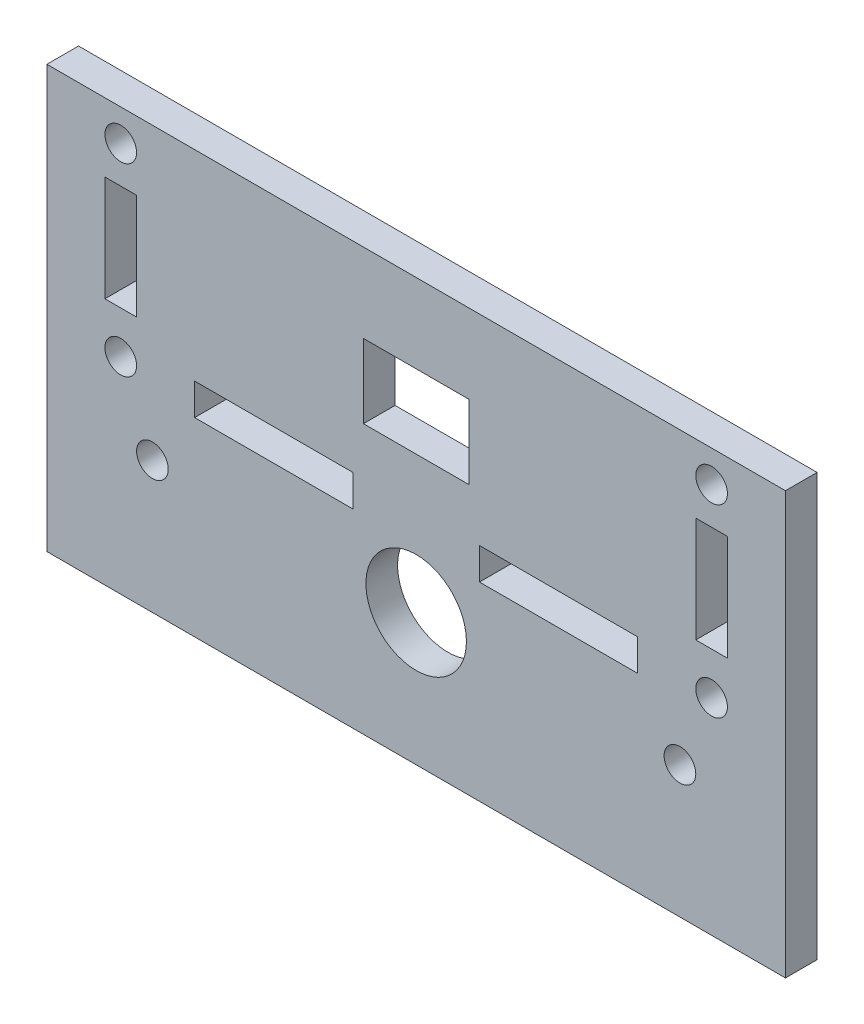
ISO-10303-21;
HEADER;
FILE_DESCRIPTION(('STEP AP214'),'2;1');
FILE_NAME('part.step','',(''),(''),'','','');
FILE_SCHEMA(('AUTOMOTIVE_DESIGN { 1 0 10303 214 1 1 1 1 }'));
ENDSEC;
DATA;
#1=APPLICATION_CONTEXT('core data for automotive mechanical design processes');
#2=APPLICATION_PROTOCOL_DEFINITION('international standard','automotive_design',2000,#1);
#3=PRODUCT_CONTEXT('',#1,'mechanical');
#4=PRODUCT('Part','Part','',(#3));
#5=PRODUCT_RELATED_PRODUCT_CATEGORY('part','',(#4));
#6=PRODUCT_DEFINITION_FORMATION('','',#4);
#7=PRODUCT_DEFINITION_CONTEXT('part definition',#1,'design');
#8=PRODUCT_DEFINITION('design','',#6,#7);
#9=PRODUCT_DEFINITION_SHAPE('','',#8);
#10=(LENGTH_UNIT() NAMED_UNIT(*) SI_UNIT(.MILLI.,.METRE.));
#11=(NAMED_UNIT(*) PLANE_ANGLE_UNIT() SI_UNIT($,.RADIAN.));
#12=(NAMED_UNIT(*) SI_UNIT($,.STERADIAN.) SOLID_ANGLE_UNIT());
#13=UNCERTAINTY_MEASURE_WITH_UNIT(LENGTH_MEASURE(1.E-05),#10,'distance_accuracy_value','');
#14=(GEOMETRIC_REPRESENTATION_CONTEXT(3) GLOBAL_UNCERTAINTY_ASSIGNED_CONTEXT((#13)) GLOBAL_UNIT_ASSIGNED_CONTEXT((#10,
#11,#12)) REPRESENTATION_CONTEXT('',''));
#15=CARTESIAN_POINT('',(0.,0.,0.));
#16=DIRECTION('',(0.,0.,1.));
#17=DIRECTION('',(1.,0.,0.));
#18=AXIS2_PLACEMENT_3D('',#15,#16,#17);
#19=CARTESIAN_POINT('',(0.,0.,3.));
#20=DIRECTION('',(0.,0.,1.));
#21=DIRECTION('',(1.,0.,0.));
#22=AXIS2_PLACEMENT_3D('',#19,#20,#21);
#23=PLANE('',#22);
#24=CARTESIAN_POINT('',(28.,24.5000000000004,3.));
#25=DIRECTION('',(0.,0.,1.));
#26=DIRECTION('',(1.,0.,0.));
#27=AXIS2_PLACEMENT_3D('',#24,#25,#26);
#28=CIRCLE('',#27,1.5);
#29=CARTESIAN_POINT('',(29.5,24.5000000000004,3.));
#30=VERTEX_POINT('',#29);
#31=EDGE_CURVE('E244',#30,#30,#28,.T.);
#32=ORIENTED_EDGE('',*,*,#31,.F.);
#33=EDGE_LOOP('',(#32));
#34=FACE_BOUND('',#33,.T.);
#35=DIRECTION('',(1.,0.,0.));
#36=VECTOR('',#35,1.);
#37=CARTESIAN_POINT('',(0.,11.0000000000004,3.));
#38=LINE('',#37,#36);
#39=CARTESIAN_POINT('',(26.5,11.0000000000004,3.));
#40=VERTEX_POINT('',#39);
#41=CARTESIAN_POINT('',(29.5,11.0000000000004,3.));
#42=VERTEX_POINT('',#41);
#43=EDGE_CURVE('E56',#40,#42,#38,.T.);
#44=ORIENTED_EDGE('',*,*,#43,.F.);
#45=DIRECTION('',(0.,1.,0.));
#46=VECTOR('',#45,1.);
#47=CARTESIAN_POINT('',(26.5,0.,3.));
#48=LINE('',#47,#46);
#49=CARTESIAN_POINT('',(26.5,21.0000000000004,3.));
#50=VERTEX_POINT('',#49);
#51=EDGE_CURVE('E237',#40,#50,#48,.T.);
#52=ORIENTED_EDGE('',*,*,#51,.T.);
#53=DIRECTION('',(1.,0.,0.));
#54=VECTOR('',#53,1.);
#55=CARTESIAN_POINT('',(0.,21.0000000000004,3.));
#56=LINE('',#55,#54);
#57=CARTESIAN_POINT('',(29.5,21.0000000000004,3.));
#58=VERTEX_POINT('',#57);
#59=EDGE_CURVE('E247',#50,#58,#56,.T.);
#60=ORIENTED_EDGE('',*,*,#59,.T.);
#61=DIRECTION('',(0.,1.,0.));
#62=VECTOR('',#61,1.);
#63=CARTESIAN_POINT('',(29.5,0.,3.));
#64=LINE('',#63,#62);
#65=EDGE_CURVE('E250',#42,#58,#64,.T.);
#66=ORIENTED_EDGE('',*,*,#65,.F.);
#67=EDGE_LOOP('',(#44,#52,#60,#66));
#68=FACE_BOUND('',#67,.T.);
#69=CARTESIAN_POINT('',(28.,7.00000000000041,3.));
#70=DIRECTION('',(0.,0.,1.));
#71=DIRECTION('',(1.,0.,0.));
#72=AXIS2_PLACEMENT_3D('',#69,#70,#71);
#73=CIRCLE('',#72,1.5);
#74=CARTESIAN_POINT('',(29.5,7.00000000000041,3.));
#75=VERTEX_POINT('',#74);
#76=EDGE_CURVE('E210',#75,#75,#73,.T.);
#77=ORIENTED_EDGE('',*,*,#76,.F.);
#78=EDGE_LOOP('',(#77));
#79=FACE_BOUND('',#78,.T.);
#80=DIRECTION('',(1.,0.,0.));
#81=VECTOR('',#80,1.);
#82=CARTESIAN_POINT('',(0.,5.50000000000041,3.));
#83=LINE('',#82,#81);
#84=CARTESIAN_POINT('',(-21.,5.50000000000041,3.));
#85=VERTEX_POINT('',#84);
#86=CARTESIAN_POINT('',(-6.,5.50000000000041,3.));
#87=VERTEX_POINT('',#86);
#88=EDGE_CURVE('E64',#85,#87,#83,.T.);
#89=ORIENTED_EDGE('',*,*,#88,.F.);
#90=DIRECTION('',(0.,1.,0.));
#91=VECTOR('',#90,1.);
#92=CARTESIAN_POINT('',(-21.,0.,3.));
#93=LINE('',#92,#91);
#94=CARTESIAN_POINT('',(-21.,8.50000000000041,3.));
#95=VERTEX_POINT('',#94);
#96=EDGE_CURVE('E213',#85,#95,#93,.T.);
#97=ORIENTED_EDGE('',*,*,#96,.T.);
#98=DIRECTION('',(1.,0.,0.));
#99=VECTOR('',#98,1.);
#100=CARTESIAN_POINT('',(0.,8.50000000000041,3.));
#101=LINE('',#100,#99);
#102=CARTESIAN_POINT('',(-6.,8.50000000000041,3.));
#103=VERTEX_POINT('',#102);
#104=EDGE_CURVE('E219',#95,#103,#101,.T.);
#105=ORIENTED_EDGE('',*,*,#104,.T.);
#106=DIRECTION('',(0.,1.,0.));
#107=VECTOR('',#106,1.);
#108=CARTESIAN_POINT('',(-6.,0.,3.));
#109=LINE('',#108,#107);
#110=EDGE_CURVE('E225',#87,#103,#109,.T.);
#111=ORIENTED_EDGE('',*,*,#110,.F.);
#112=EDGE_LOOP('',(#89,#97,#105,#111));
#113=FACE_BOUND('',#112,.T.);
#114=CARTESIAN_POINT('',(-28.,7.00000000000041,3.));
#115=DIRECTION('',(0.,0.,1.));
#116=DIRECTION('',(1.,0.,0.));
#117=AXIS2_PLACEMENT_3D('',#114,#115,#116);
#118=CIRCLE('',#117,1.5);
#119=CARTESIAN_POINT('',(-26.5,7.00000000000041,3.));
#120=VERTEX_POINT('',#119);
#121=EDGE_CURVE('E259',#120,#120,#118,.T.);
#122=ORIENTED_EDGE('',*,*,#121,.F.);
#123=EDGE_LOOP('',(#122));
#124=FACE_BOUND('',#123,.T.);
#125=DIRECTION('',(0.,1.,0.));
#126=VECTOR('',#125,1.);
#127=CARTESIAN_POINT('',(-26.5,-1.83880688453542E-13,3.));
#128=LINE('',#127,#126);
#129=CARTESIAN_POINT('',(-26.5000000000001,11.0000000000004,3.));
#130=VERTEX_POINT('',#129);
#131=CARTESIAN_POINT('',(-26.5000000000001,21.0000000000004,3.));
#132=VERTEX_POINT('',#131);
#133=EDGE_CURVE('E283',#130,#132,#128,.T.);
#134=ORIENTED_EDGE('',*,*,#133,.F.);
#135=DIRECTION('',(-1.,0.,0.));
#136=VECTOR('',#135,1.);
#137=CARTESIAN_POINT('',(0.,11.0000000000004,3.));
#138=LINE('',#137,#136);
#139=CARTESIAN_POINT('',(-29.5000000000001,11.0000000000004,3.));
#140=VERTEX_POINT('',#139);
#141=EDGE_CURVE('E280',#130,#140,#138,.T.);
#142=ORIENTED_EDGE('',*,*,#141,.T.);
#143=DIRECTION('',(0.,1.,0.));
#144=VECTOR('',#143,1.);
#145=CARTESIAN_POINT('',(-29.5,-2.04697370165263E-13,3.));
#146=LINE('',#145,#144);
#147=CARTESIAN_POINT('',(-29.5000000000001,21.0000000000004,3.));
#148=VERTEX_POINT('',#147);
#149=EDGE_CURVE('E289',#140,#148,#146,.T.);
#150=ORIENTED_EDGE('',*,*,#149,.T.);
#151=DIRECTION('',(-1.,0.,0.));
#152=VECTOR('',#151,1.);
#153=CARTESIAN_POINT('',(0.,21.0000000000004,3.));
#154=LINE('',#153,#152);
#155=EDGE_CURVE('E286',#132,#148,#154,.T.);
#156=ORIENTED_EDGE('',*,*,#155,.F.);
#157=EDGE_LOOP('',(#134,#142,#150,#156));
#158=FACE_BOUND('',#157,.T.);
#159=DIRECTION('',(1.,0.,0.));
#160=VECTOR('',#159,1.);
#161=CARTESIAN_POINT('',(0.,20.,3.));
#162=LINE('',#161,#160);
#163=CARTESIAN_POINT('',(-5.00000000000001,20.,3.));
#164=VERTEX_POINT('',#163);
#165=CARTESIAN_POINT('',(4.99999999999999,20.,3.));
#166=VERTEX_POINT('',#165);
#167=EDGE_CURVE('E323',#164,#166,#162,.T.);
#168=ORIENTED_EDGE('',*,*,#167,.T.);
#169=DIRECTION('',(0.,-1.,0.));
#170=VECTOR('',#169,1.);
#171=CARTESIAN_POINT('',(4.99999999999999,0.,3.));
#172=LINE('',#171,#170);
#173=CARTESIAN_POINT('',(4.99999999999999,13.,3.));
#174=VERTEX_POINT('',#173);
#175=EDGE_CURVE('E326',#166,#174,#172,.T.);
#176=ORIENTED_EDGE('',*,*,#175,.T.);
#177=DIRECTION('',(1.,0.,0.));
#178=VECTOR('',#177,1.);
#179=CARTESIAN_POINT('',(0.,13.,3.));
#180=LINE('',#179,#178);
#181=CARTESIAN_POINT('',(-5.00000000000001,13.,3.));
#182=VERTEX_POINT('',#181);
#183=EDGE_CURVE('E328',#182,#174,#180,.T.);
#184=ORIENTED_EDGE('',*,*,#183,.F.);
#185=DIRECTION('',(0.,-1.,0.));
#186=VECTOR('',#185,1.);
#187=CARTESIAN_POINT('',(-5.,0.,3.));
#188=LINE('',#187,#186);
#189=EDGE_CURVE('E331',#164,#182,#188,.T.);
#190=ORIENTED_EDGE('',*,*,#189,.F.);
#191=EDGE_LOOP('',(#168,#176,#184,#190));
#192=FACE_BOUND('',#191,.T.);
#193=DIRECTION('',(1.,0.,0.));
#194=VECTOR('',#193,1.);
#195=CARTESIAN_POINT('',(0.,-12.5,3.));
#196=LINE('',#195,#194);
#197=CARTESIAN_POINT('',(-35.,-12.5,3.));
#198=VERTEX_POINT('',#197);
#199=CARTESIAN_POINT('',(35.,-12.5,3.));
#200=VERTEX_POINT('',#199);
#201=EDGE_CURVE('E312',#198,#200,#196,.T.);
#202=ORIENTED_EDGE('',*,*,#201,.T.);
#203=DIRECTION('',(0.,1.,0.));
#204=VECTOR('',#203,1.);
#205=CARTESIAN_POINT('',(35.,0.,3.));
#206=LINE('',#205,#204);
#207=CARTESIAN_POINT('',(35.,27.5,3.));
#208=VERTEX_POINT('',#207);
#209=EDGE_CURVE('E315',#200,#208,#206,.T.);
#210=ORIENTED_EDGE('',*,*,#209,.T.);
#211=DIRECTION('',(1.,0.,0.));
#212=VECTOR('',#211,1.);
#213=CARTESIAN_POINT('',(0.,27.5,3.));
#214=LINE('',#213,#212);
#215=CARTESIAN_POINT('',(-35.,27.5,3.));
#216=VERTEX_POINT('',#215);
#217=EDGE_CURVE('E317',#216,#208,#214,.T.);
#218=ORIENTED_EDGE('',*,*,#217,.F.);
#219=DIRECTION('',(0.,1.,0.));
#220=VECTOR('',#219,1.);
#221=CARTESIAN_POINT('',(-35.,0.,3.));
#222=LINE('',#221,#220);
#223=EDGE_CURVE('E320',#198,#216,#222,.T.);
#224=ORIENTED_EDGE('',*,*,#223,.F.);
#225=EDGE_LOOP('',(#202,#210,#218,#224));
#226=FACE_BOUND('',#225,.T.);
#227=CARTESIAN_POINT('',(0.,0.,3.));
#228=DIRECTION('',(0.,0.,1.));
#229=DIRECTION('',(1.,0.,0.));
#230=AXIS2_PLACEMENT_3D('',#227,#228,#229);
#231=CIRCLE('',#230,4.7625);
#232=CARTESIAN_POINT('',(4.7625,0.,3.));
#233=VERTEX_POINT('',#232);
#234=EDGE_CURVE('E309',#233,#233,#231,.T.);
#235=ORIENTED_EDGE('',*,*,#234,.F.);
#236=EDGE_LOOP('',(#235));
#237=FACE_BOUND('',#236,.T.);
#238=CARTESIAN_POINT('',(-25.,0.,3.));
#239=DIRECTION('',(0.,0.,1.));
#240=DIRECTION('',(1.,0.,0.));
#241=AXIS2_PLACEMENT_3D('',#238,#239,#240);
#242=CIRCLE('',#241,1.5);
#243=CARTESIAN_POINT('',(-23.5,0.,3.));
#244=VERTEX_POINT('',#243);
#245=EDGE_CURVE('E305',#244,#244,#242,.T.);
#246=ORIENTED_EDGE('',*,*,#245,.F.);
#247=EDGE_LOOP('',(#246));
#248=FACE_BOUND('',#247,.T.);
#249=CARTESIAN_POINT('',(25.,0.,3.));
#250=DIRECTION('',(0.,0.,1.));
#251=DIRECTION('',(1.,0.,0.));
#252=AXIS2_PLACEMENT_3D('',#249,#250,#251);
#253=CIRCLE('',#252,1.5);
#254=CARTESIAN_POINT('',(26.5,0.,3.));
#255=VERTEX_POINT('',#254);
#256=EDGE_CURVE('E302',#255,#255,#253,.T.);
#257=ORIENTED_EDGE('',*,*,#256,.F.);
#258=EDGE_LOOP('',(#257));
#259=FACE_BOUND('',#258,.T.);
#260=DIRECTION('',(1.,0.,0.));
#261=VECTOR('',#260,1.);
#262=CARTESIAN_POINT('',(0.,5.50000000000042,3.));
#263=LINE('',#262,#261);
#264=CARTESIAN_POINT('',(6.,5.50000000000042,3.));
#265=VERTEX_POINT('',#264);
#266=CARTESIAN_POINT('',(21.,5.50000000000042,3.));
#267=VERTEX_POINT('',#266);
#268=EDGE_CURVE('E260',#265,#267,#263,.T.);
#269=ORIENTED_EDGE('',*,*,#268,.F.);
#270=DIRECTION('',(0.,1.,0.));
#271=VECTOR('',#270,1.);
#272=CARTESIAN_POINT('',(6.,0.,3.));
#273=LINE('',#272,#271);
#274=CARTESIAN_POINT('',(6.,8.50000000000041,3.));
#275=VERTEX_POINT('',#274);
#276=EDGE_CURVE('E264',#265,#275,#273,.T.);
#277=ORIENTED_EDGE('',*,*,#276,.T.);
#278=DIRECTION('',(1.,0.,0.));
#279=VECTOR('',#278,1.);
#280=CARTESIAN_POINT('',(0.,8.50000000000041,3.));
#281=LINE('',#280,#279);
#282=CARTESIAN_POINT('',(21.,8.50000000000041,3.));
#283=VERTEX_POINT('',#282);
#284=EDGE_CURVE('E270',#275,#283,#281,.T.);
#285=ORIENTED_EDGE('',*,*,#284,.T.);
#286=DIRECTION('',(0.,1.,0.));
#287=VECTOR('',#286,1.);
#288=CARTESIAN_POINT('',(21.,0.,3.));
#289=LINE('',#288,#287);
#290=EDGE_CURVE('E273',#267,#283,#289,.T.);
#291=ORIENTED_EDGE('',*,*,#290,.F.);
#292=EDGE_LOOP('',(#269,#277,#285,#291));
#293=FACE_BOUND('',#292,.T.);
#294=CARTESIAN_POINT('',(-28.0000000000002,24.5000000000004,3.));
#295=DIRECTION('',(0.,0.,1.));
#296=DIRECTION('',(1.,0.,0.));
#297=AXIS2_PLACEMENT_3D('',#294,#295,#296);
#298=CIRCLE('',#297,1.5);
#299=CARTESIAN_POINT('',(-26.5000000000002,24.5000000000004,3.));
#300=VERTEX_POINT('',#299);
#301=EDGE_CURVE('E256',#300,#300,#298,.F.);
#302=ORIENTED_EDGE('',*,*,#301,.T.);
#303=EDGE_LOOP('',(#302));
#304=FACE_BOUND('',#303,.T.);
#305=ADVANCED_FACE('F40',(#34,#68,#79,#113,#124,#158,#192,#226,#237,#248,#259,#293,#304),#23,.T.);
#306=CARTESIAN_POINT('',(0.,0.,0.));
#307=DIRECTION('',(0.,0.,1.));
#308=DIRECTION('',(1.,0.,0.));
#309=AXIS2_PLACEMENT_3D('',#306,#307,#308);
#310=PLANE('',#309);
#311=CARTESIAN_POINT('',(28.,24.5000000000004,0.));
#312=DIRECTION('',(0.,0.,1.));
#313=DIRECTION('',(1.,0.,0.));
#314=AXIS2_PLACEMENT_3D('',#311,#312,#313);
#315=CIRCLE('',#314,1.5);
#316=CARTESIAN_POINT('',(29.5,24.5000000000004,0.));
#317=VERTEX_POINT('',#316);
#318=EDGE_CURVE('E44',#317,#317,#315,.T.);
#319=ORIENTED_EDGE('',*,*,#318,.T.);
#320=EDGE_LOOP('',(#319));
#321=FACE_BOUND('',#320,.T.);
#322=DIRECTION('',(0.,1.,0.));
#323=VECTOR('',#322,1.);
#324=CARTESIAN_POINT('',(26.5,0.,0.));
#325=LINE('',#324,#323);
#326=CARTESIAN_POINT('',(26.5,11.0000000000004,0.));
#327=VERTEX_POINT('',#326);
#328=CARTESIAN_POINT('',(26.5,21.0000000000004,0.));
#329=VERTEX_POINT('',#328);
#330=EDGE_CURVE('E49',#327,#329,#325,.T.);
#331=ORIENTED_EDGE('',*,*,#330,.F.);
#332=DIRECTION('',(1.,0.,0.));
#333=VECTOR('',#332,1.);
#334=CARTESIAN_POINT('',(0.,11.0000000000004,0.));
#335=LINE('',#334,#333);
#336=CARTESIAN_POINT('',(29.5,11.0000000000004,0.));
#337=VERTEX_POINT('',#336);
#338=EDGE_CURVE('E12',#327,#337,#335,.T.);
#339=ORIENTED_EDGE('',*,*,#338,.T.);
#340=DIRECTION('',(0.,1.,0.));
#341=VECTOR('',#340,1.);
#342=CARTESIAN_POINT('',(29.5,0.,0.));
#343=LINE('',#342,#341);
#344=CARTESIAN_POINT('',(29.5,21.0000000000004,0.));
#345=VERTEX_POINT('',#344);
#346=EDGE_CURVE('E419',#337,#345,#343,.T.);
#347=ORIENTED_EDGE('',*,*,#346,.T.);
#348=DIRECTION('',(1.,0.,0.));
#349=VECTOR('',#348,1.);
#350=CARTESIAN_POINT('',(0.,21.0000000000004,0.));
#351=LINE('',#350,#349);
#352=EDGE_CURVE('E424',#329,#345,#351,.T.);
#353=ORIENTED_EDGE('',*,*,#352,.F.);
#354=EDGE_LOOP('',(#331,#339,#347,#353));
#355=FACE_BOUND('',#354,.T.);
#356=CARTESIAN_POINT('',(28.,7.00000000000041,0.));
#357=DIRECTION('',(0.,0.,1.));
#358=DIRECTION('',(1.,0.,0.));
#359=AXIS2_PLACEMENT_3D('',#356,#357,#358);
#360=CIRCLE('',#359,1.5);
#361=CARTESIAN_POINT('',(29.5,7.00000000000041,0.));
#362=VERTEX_POINT('',#361);
#363=EDGE_CURVE('E410',#362,#362,#360,.T.);
#364=ORIENTED_EDGE('',*,*,#363,.T.);
#365=EDGE_LOOP('',(#364));
#366=FACE_BOUND('',#365,.T.);
#367=DIRECTION('',(0.,1.,0.));
#368=VECTOR('',#367,1.);
#369=CARTESIAN_POINT('',(-21.,0.,0.));
#370=LINE('',#369,#368);
#371=CARTESIAN_POINT('',(-21.,5.50000000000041,0.));
#372=VERTEX_POINT('',#371);
#373=CARTESIAN_POINT('',(-21.,8.50000000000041,0.));
#374=VERTEX_POINT('',#373);
#375=EDGE_CURVE('E416',#372,#374,#370,.T.);
#376=ORIENTED_EDGE('',*,*,#375,.F.);
#377=DIRECTION('',(1.,0.,0.));
#378=VECTOR('',#377,1.);
#379=CARTESIAN_POINT('',(0.,5.50000000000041,0.));
#380=LINE('',#379,#378);
#381=CARTESIAN_POINT('',(-6.,5.50000000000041,0.));
#382=VERTEX_POINT('',#381);
#383=EDGE_CURVE('E206',#372,#382,#380,.T.);
#384=ORIENTED_EDGE('',*,*,#383,.T.);
#385=DIRECTION('',(0.,1.,0.));
#386=VECTOR('',#385,1.);
#387=CARTESIAN_POINT('',(-6.,0.,0.));
#388=LINE('',#387,#386);
#389=CARTESIAN_POINT('',(-6.,8.50000000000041,0.));
#390=VERTEX_POINT('',#389);
#391=EDGE_CURVE('E404',#382,#390,#388,.T.);
#392=ORIENTED_EDGE('',*,*,#391,.T.);
#393=DIRECTION('',(1.,0.,0.));
#394=VECTOR('',#393,1.);
#395=CARTESIAN_POINT('',(0.,8.50000000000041,0.));
#396=LINE('',#395,#394);
#397=EDGE_CURVE('E413',#374,#390,#396,.T.);
#398=ORIENTED_EDGE('',*,*,#397,.F.);
#399=EDGE_LOOP('',(#376,#384,#392,#398));
#400=FACE_BOUND('',#399,.T.);
#401=CARTESIAN_POINT('',(-28.,7.00000000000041,0.));
#402=DIRECTION('',(0.,0.,1.));
#403=DIRECTION('',(1.,0.,0.));
#404=AXIS2_PLACEMENT_3D('',#401,#402,#403);
#405=CIRCLE('',#404,1.5);
#406=CARTESIAN_POINT('',(-26.5,7.00000000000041,0.));
#407=VERTEX_POINT('',#406);
#408=EDGE_CURVE('E407',#407,#407,#405,.T.);
#409=ORIENTED_EDGE('',*,*,#408,.T.);
#410=EDGE_LOOP('',(#409));
#411=FACE_BOUND('',#410,.T.);
#412=DIRECTION('',(0.,1.,0.));
#413=VECTOR('',#412,1.);
#414=CARTESIAN_POINT('',(6.,0.,0.));
#415=LINE('',#414,#413);
#416=CARTESIAN_POINT('',(6.,5.50000000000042,0.));
#417=VERTEX_POINT('',#416);
#418=CARTESIAN_POINT('',(6.,8.50000000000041,0.));
#419=VERTEX_POINT('',#418);
#420=EDGE_CURVE('E399',#417,#419,#415,.T.);
#421=ORIENTED_EDGE('',*,*,#420,.F.);
#422=DIRECTION('',(1.,0.,0.));
#423=VECTOR('',#422,1.);
#424=CARTESIAN_POINT('',(0.,5.50000000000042,0.));
#425=LINE('',#424,#423);
#426=CARTESIAN_POINT('',(21.,5.50000000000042,0.));
#427=VERTEX_POINT('',#426);
#428=EDGE_CURVE('E401',#417,#427,#425,.T.);
#429=ORIENTED_EDGE('',*,*,#428,.T.);
#430=DIRECTION('',(0.,1.,0.));
#431=VECTOR('',#430,1.);
#432=CARTESIAN_POINT('',(21.,0.,0.));
#433=LINE('',#432,#431);
#434=CARTESIAN_POINT('',(21.,8.50000000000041,0.));
#435=VERTEX_POINT('',#434);
#436=EDGE_CURVE('E393',#427,#435,#433,.T.);
#437=ORIENTED_EDGE('',*,*,#436,.T.);
#438=DIRECTION('',(1.,0.,0.));
#439=VECTOR('',#438,1.);
#440=CARTESIAN_POINT('',(0.,8.50000000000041,0.));
#441=LINE('',#440,#439);
#442=EDGE_CURVE('E396',#419,#435,#441,.T.);
#443=ORIENTED_EDGE('',*,*,#442,.F.);
#444=EDGE_LOOP('',(#421,#429,#437,#443));
#445=FACE_BOUND('',#444,.T.);
#446=DIRECTION('',(1.,0.,0.));
#447=VECTOR('',#446,1.);
#448=CARTESIAN_POINT('',(0.,20.,0.));
#449=LINE('',#448,#447);
#450=CARTESIAN_POINT('',(-5.00000000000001,20.,0.));
#451=VERTEX_POINT('',#450);
#452=CARTESIAN_POINT('',(4.99999999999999,20.,0.));
#453=VERTEX_POINT('',#452);
#454=EDGE_CURVE('E355',#451,#453,#449,.T.);
#455=ORIENTED_EDGE('',*,*,#454,.F.);
#456=DIRECTION('',(0.,-1.,0.));
#457=VECTOR('',#456,1.);
#458=CARTESIAN_POINT('',(-5.,0.,0.));
#459=LINE('',#458,#457);
#460=CARTESIAN_POINT('',(-5.00000000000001,13.,0.));
#461=VERTEX_POINT('',#460);
#462=EDGE_CURVE('E306',#451,#461,#459,.T.);
#463=ORIENTED_EDGE('',*,*,#462,.T.);
#464=DIRECTION('',(1.,0.,0.));
#465=VECTOR('',#464,1.);
#466=CARTESIAN_POINT('',(0.,13.,0.));
#467=LINE('',#466,#465);
#468=CARTESIAN_POINT('',(4.99999999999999,13.,0.));
#469=VERTEX_POINT('',#468);
#470=EDGE_CURVE('E361',#461,#469,#467,.T.);
#471=ORIENTED_EDGE('',*,*,#470,.T.);
#472=DIRECTION('',(0.,-1.,0.));
#473=VECTOR('',#472,1.);
#474=CARTESIAN_POINT('',(4.99999999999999,0.,0.));
#475=LINE('',#474,#473);
#476=EDGE_CURVE('E358',#453,#469,#475,.T.);
#477=ORIENTED_EDGE('',*,*,#476,.F.);
#478=EDGE_LOOP('',(#455,#463,#471,#477));
#479=FACE_BOUND('',#478,.T.);
#480=DIRECTION('',(1.,0.,0.));
#481=VECTOR('',#480,1.);
#482=CARTESIAN_POINT('',(0.,-12.5,0.));
#483=LINE('',#482,#481);
#484=CARTESIAN_POINT('',(-35.,-12.5,0.));
#485=VERTEX_POINT('',#484);
#486=CARTESIAN_POINT('',(35.,-12.5,0.));
#487=VERTEX_POINT('',#486);
#488=EDGE_CURVE('E343',#485,#487,#483,.T.);
#489=ORIENTED_EDGE('',*,*,#488,.F.);
#490=DIRECTION('',(0.,1.,0.));
#491=VECTOR('',#490,1.);
#492=CARTESIAN_POINT('',(-35.,0.,0.));
#493=LINE('',#492,#491);
#494=CARTESIAN_POINT('',(-35.,27.5,0.));
#495=VERTEX_POINT('',#494);
#496=EDGE_CURVE('E352',#485,#495,#493,.T.);
#497=ORIENTED_EDGE('',*,*,#496,.T.);
#498=DIRECTION('',(1.,0.,0.));
#499=VECTOR('',#498,1.);
#500=CARTESIAN_POINT('',(0.,27.5,0.));
#501=LINE('',#500,#499);
#502=CARTESIAN_POINT('',(35.,27.5,0.));
#503=VERTEX_POINT('',#502);
#504=EDGE_CURVE('E349',#495,#503,#501,.T.);
#505=ORIENTED_EDGE('',*,*,#504,.T.);
#506=DIRECTION('',(0.,1.,0.));
#507=VECTOR('',#506,1.);
#508=CARTESIAN_POINT('',(35.,0.,0.));
#509=LINE('',#508,#507);
#510=EDGE_CURVE('E346',#487,#503,#509,.T.);
#511=ORIENTED_EDGE('',*,*,#510,.F.);
#512=EDGE_LOOP('',(#489,#497,#505,#511));
#513=FACE_BOUND('',#512,.T.);
#514=CARTESIAN_POINT('',(0.,0.,0.));
#515=DIRECTION('',(0.,0.,1.));
#516=DIRECTION('',(1.,0.,0.));
#517=AXIS2_PLACEMENT_3D('',#514,#515,#516);
#518=CIRCLE('',#517,4.7625);
#519=CARTESIAN_POINT('',(4.7625,0.,0.));
#520=VERTEX_POINT('',#519);
#521=EDGE_CURVE('E340',#520,#520,#518,.T.);
#522=ORIENTED_EDGE('',*,*,#521,.T.);
#523=EDGE_LOOP('',(#522));
#524=FACE_BOUND('',#523,.T.);
#525=CARTESIAN_POINT('',(-25.,0.,0.));
#526=DIRECTION('',(0.,0.,1.));
#527=DIRECTION('',(1.,0.,0.));
#528=AXIS2_PLACEMENT_3D('',#525,#526,#527);
#529=CIRCLE('',#528,1.5);
#530=CARTESIAN_POINT('',(-23.5,0.,0.));
#531=VERTEX_POINT('',#530);
#532=EDGE_CURVE('E337',#531,#531,#529,.T.);
#533=ORIENTED_EDGE('',*,*,#532,.T.);
#534=EDGE_LOOP('',(#533));
#535=FACE_BOUND('',#534,.T.);
#536=CARTESIAN_POINT('',(25.,0.,0.));
#537=DIRECTION('',(0.,0.,1.));
#538=DIRECTION('',(1.,0.,0.));
#539=AXIS2_PLACEMENT_3D('',#536,#537,#538);
#540=CIRCLE('',#539,1.5);
#541=CARTESIAN_POINT('',(26.5,0.,0.));
#542=VERTEX_POINT('',#541);
#543=EDGE_CURVE('E295',#542,#542,#540,.T.);
#544=ORIENTED_EDGE('',*,*,#543,.T.);
#545=EDGE_LOOP('',(#544));
#546=FACE_BOUND('',#545,.T.);
#547=DIRECTION('',(-1.,0.,0.));
#548=VECTOR('',#547,1.);
#549=CARTESIAN_POINT('',(0.,11.0000000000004,0.));
#550=LINE('',#549,#548);
#551=CARTESIAN_POINT('',(-26.5000000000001,11.0000000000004,0.));
#552=VERTEX_POINT('',#551);
#553=CARTESIAN_POINT('',(-29.5000000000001,11.0000000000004,0.));
#554=VERTEX_POINT('',#553);
#555=EDGE_CURVE('E391',#552,#554,#550,.T.);
#556=ORIENTED_EDGE('',*,*,#555,.F.);
#557=DIRECTION('',(0.,1.,0.));
#558=VECTOR('',#557,1.);
#559=CARTESIAN_POINT('',(-26.5,-1.83880688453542E-13,0.));
#560=LINE('',#559,#558);
#561=CARTESIAN_POINT('',(-26.5000000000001,21.0000000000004,0.));
#562=VERTEX_POINT('',#561);
#563=EDGE_CURVE('E376',#552,#562,#560,.T.);
#564=ORIENTED_EDGE('',*,*,#563,.T.);
#565=DIRECTION('',(-1.,0.,0.));
#566=VECTOR('',#565,1.);
#567=CARTESIAN_POINT('',(0.,21.0000000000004,0.));
#568=LINE('',#567,#566);
#569=CARTESIAN_POINT('',(-29.5000000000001,21.0000000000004,0.));
#570=VERTEX_POINT('',#569);
#571=EDGE_CURVE('E386',#562,#570,#568,.T.);
#572=ORIENTED_EDGE('',*,*,#571,.T.);
#573=DIRECTION('',(0.,1.,0.));
#574=VECTOR('',#573,1.);
#575=CARTESIAN_POINT('',(-29.5,-2.04697370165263E-13,0.));
#576=LINE('',#575,#574);
#577=EDGE_CURVE('E389',#554,#570,#576,.T.);
#578=ORIENTED_EDGE('',*,*,#577,.F.);
#579=EDGE_LOOP('',(#556,#564,#572,#578));
#580=FACE_BOUND('',#579,.T.);
#581=CARTESIAN_POINT('',(-28.0000000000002,24.5000000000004,0.));
#582=DIRECTION('',(0.,0.,1.));
#583=DIRECTION('',(1.,0.,0.));
#584=AXIS2_PLACEMENT_3D('',#581,#582,#583);
#585=CIRCLE('',#584,1.5);
#586=CARTESIAN_POINT('',(-26.5000000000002,24.5000000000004,0.));
#587=VERTEX_POINT('',#586);
#588=EDGE_CURVE('E279',#587,#587,#585,.F.);
#589=ORIENTED_EDGE('',*,*,#588,.F.);
#590=EDGE_LOOP('',(#589));
#591=FACE_BOUND('',#590,.T.);
#592=ADVANCED_FACE('F438',(#321,#355,#366,#400,#411,#445,#479,#513,#524,#535,#546,#580,#591),
#310,.F.);
#593=CARTESIAN_POINT('',(0.,20.,3.));
#594=DIRECTION('',(0.,1.,0.));
#595=DIRECTION('',(0.,0.,1.));
#596=AXIS2_PLACEMENT_3D('',#593,#594,#595);
#597=PLANE('',#596);
#598=ORIENTED_EDGE('',*,*,#454,.T.);
#599=DIRECTION('',(0.,0.,-1.));
#600=VECTOR('',#599,1.);
#601=CARTESIAN_POINT('',(4.99999999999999,20.,3.));
#602=LINE('',#601,#600);
#603=EDGE_CURVE('E373',#166,#453,#602,.T.);
#604=ORIENTED_EDGE('',*,*,#603,.F.);
#605=ORIENTED_EDGE('',*,*,#167,.F.);
#606=DIRECTION('',(0.,0.,-1.));
#607=VECTOR('',#606,1.);
#608=CARTESIAN_POINT('',(-5.00000000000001,20.,3.));
#609=LINE('',#608,#607);
#610=EDGE_CURVE('E366',#164,#451,#609,.T.);
#611=ORIENTED_EDGE('',*,*,#610,.T.);
#612=EDGE_LOOP('',(#598,#604,#605,#611));
#613=FACE_BOUND('',#612,.T.);
#614=ADVANCED_FACE('F459',(#613),#597,.F.);
#615=CARTESIAN_POINT('',(4.99999999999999,0.,3.));
#616=DIRECTION('',(1.,0.,0.));
#617=DIRECTION('',(0.,0.,-1.));
#618=AXIS2_PLACEMENT_3D('',#615,#616,#617);
#619=PLANE('',#618);
#620=ORIENTED_EDGE('',*,*,#476,.T.);
#621=DIRECTION('',(0.,0.,-1.));
#622=VECTOR('',#621,1.);
#623=CARTESIAN_POINT('',(4.99999999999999,13.,3.));
#624=LINE('',#623,#622);
#625=EDGE_CURVE('E371',#174,#469,#624,.T.);
#626=ORIENTED_EDGE('',*,*,#625,.F.);
#627=ORIENTED_EDGE('',*,*,#175,.F.);
#628=ORIENTED_EDGE('',*,*,#603,.T.);
#629=EDGE_LOOP('',(#620,#626,#627,#628));
#630=FACE_BOUND('',#629,.T.);
#631=ADVANCED_FACE('F541',(#630),#619,.F.);
#632=CARTESIAN_POINT('',(0.,13.,3.));
#633=DIRECTION('',(0.,1.,0.));
#634=DIRECTION('',(0.,0.,1.));
#635=AXIS2_PLACEMENT_3D('',#632,#633,#634);
#636=PLANE('',#635);
#637=ORIENTED_EDGE('',*,*,#470,.F.);
#638=DIRECTION('',(0.,0.,-1.));
#639=VECTOR('',#638,1.);
#640=CARTESIAN_POINT('',(-5.00000000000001,13.,3.));
#641=LINE('',#640,#639);
#642=EDGE_CURVE('E368',#182,#461,#641,.T.);
#643=ORIENTED_EDGE('',*,*,#642,.F.);
#644=ORIENTED_EDGE('',*,*,#183,.T.);
#645=ORIENTED_EDGE('',*,*,#625,.T.);
#646=EDGE_LOOP('',(#637,#643,#644,#645));
#647=FACE_BOUND('',#646,.T.);
#648=ADVANCED_FACE('F537',(#647),#636,.T.);
#649=CARTESIAN_POINT('',(0.,-12.5,3.));
#650=DIRECTION('',(0.,1.,0.));
#651=DIRECTION('',(0.,0.,1.));
#652=AXIS2_PLACEMENT_3D('',#649,#650,#651);
#653=PLANE('',#652);
#654=ORIENTED_EDGE('',*,*,#488,.T.);
#655=DIRECTION('',(0.,0.,-1.));
#656=VECTOR('',#655,1.);
#657=CARTESIAN_POINT('',(35.,-12.5,3.));
#658=LINE('',#657,#656);
#659=EDGE_CURVE('E369',#200,#487,#658,.T.);
#660=ORIENTED_EDGE('',*,*,#659,.F.);
#661=ORIENTED_EDGE('',*,*,#201,.F.);
#662=DIRECTION('',(0.,0.,-1.));
#663=VECTOR('',#662,1.);
#664=CARTESIAN_POINT('',(-35.,-12.5,3.));
#665=LINE('',#664,#663);
#666=EDGE_CURVE('E334',#198,#485,#665,.T.);
#667=ORIENTED_EDGE('',*,*,#666,.T.);
#668=EDGE_LOOP('',(#654,#660,#661,#667));
#669=FACE_BOUND('',#668,.T.);
#670=ADVANCED_FACE('F540',(#669),#653,.F.);
#671=CARTESIAN_POINT('',(35.,0.,3.));
#672=DIRECTION('',(-1.,0.,0.));
#673=DIRECTION('',(0.,0.,1.));
#674=AXIS2_PLACEMENT_3D('',#671,#672,#673);
#675=PLANE('',#674);
#676=ORIENTED_EDGE('',*,*,#510,.T.);
#677=DIRECTION('',(0.,0.,-1.));
#678=VECTOR('',#677,1.);
#679=CARTESIAN_POINT('',(35.,27.5,3.));
#680=LINE('',#679,#678);
#681=EDGE_CURVE('E380',#208,#503,#680,.T.);
#682=ORIENTED_EDGE('',*,*,#681,.F.);
#683=ORIENTED_EDGE('',*,*,#209,.F.);
#684=ORIENTED_EDGE('',*,*,#659,.T.);
#685=EDGE_LOOP('',(#676,#682,#683,#684));
#686=FACE_BOUND('',#685,.T.);
#687=ADVANCED_FACE('F557',(#686),#675,.F.);
#688=CARTESIAN_POINT('',(0.,27.5,3.));
#689=DIRECTION('',(0.,1.,0.));
#690=DIRECTION('',(0.,0.,1.));
#691=AXIS2_PLACEMENT_3D('',#688,#689,#690);
#692=PLANE('',#691);
#693=ORIENTED_EDGE('',*,*,#504,.F.);
#694=DIRECTION('',(0.,0.,-1.));
#695=VECTOR('',#694,1.);
#696=CARTESIAN_POINT('',(-35.,27.5,3.));
#697=LINE('',#696,#695);
#698=EDGE_CURVE('E378',#216,#495,#697,.T.);
#699=ORIENTED_EDGE('',*,*,#698,.F.);
#700=ORIENTED_EDGE('',*,*,#217,.T.);
#701=ORIENTED_EDGE('',*,*,#681,.T.);
#702=EDGE_LOOP('',(#693,#699,#700,#701));
#703=FACE_BOUND('',#702,.T.);
#704=ADVANCED_FACE('F553',(#703),#692,.T.);
#705=CARTESIAN_POINT('',(-35.,0.,3.));
#706=DIRECTION('',(-1.,0.,0.));
#707=DIRECTION('',(0.,0.,1.));
#708=AXIS2_PLACEMENT_3D('',#705,#706,#707);
#709=PLANE('',#708);
#710=ORIENTED_EDGE('',*,*,#496,.F.);
#711=ORIENTED_EDGE('',*,*,#666,.F.);
#712=ORIENTED_EDGE('',*,*,#223,.T.);
#713=ORIENTED_EDGE('',*,*,#698,.T.);
#714=EDGE_LOOP('',(#710,#711,#712,#713));
#715=FACE_BOUND('',#714,.T.);
#716=ADVANCED_FACE('F549',(#715),#709,.T.);
#717=CARTESIAN_POINT('',(0.,0.,3.));
#718=DIRECTION('',(0.,0.,-1.));
#719=DIRECTION('',(-1.,0.,0.));
#720=AXIS2_PLACEMENT_3D('',#717,#718,#719);
#721=CYLINDRICAL_SURFACE('',#720,4.7625);
#722=ORIENTED_EDGE('',*,*,#234,.T.);
#723=EDGE_LOOP('',(#722));
#724=FACE_BOUND('',#723,.T.);
#725=ORIENTED_EDGE('',*,*,#521,.F.);
#726=EDGE_LOOP('',(#725));
#727=FACE_BOUND('',#726,.T.);
#728=ADVANCED_FACE('F552',(#724,#727),#721,.F.);
#729=CARTESIAN_POINT('',(-25.,0.,3.));
#730=DIRECTION('',(0.,0.,-1.));
#731=DIRECTION('',(-1.,0.,0.));
#732=AXIS2_PLACEMENT_3D('',#729,#730,#731);
#733=CYLINDRICAL_SURFACE('',#732,1.5);
#734=ORIENTED_EDGE('',*,*,#245,.T.);
#735=EDGE_LOOP('',(#734));
#736=FACE_BOUND('',#735,.T.);
#737=ORIENTED_EDGE('',*,*,#532,.F.);
#738=EDGE_LOOP('',(#737));
#739=FACE_BOUND('',#738,.T.);
#740=ADVANCED_FACE('F566',(#736,#739),#733,.F.);
#741=CARTESIAN_POINT('',(25.,0.,3.));
#742=DIRECTION('',(0.,0.,-1.));
#743=DIRECTION('',(-1.,0.,0.));
#744=AXIS2_PLACEMENT_3D('',#741,#742,#743);
#745=CYLINDRICAL_SURFACE('',#744,1.5);
#746=ORIENTED_EDGE('',*,*,#256,.T.);
#747=EDGE_LOOP('',(#746));
#748=FACE_BOUND('',#747,.T.);
#749=ORIENTED_EDGE('',*,*,#543,.F.);
#750=EDGE_LOOP('',(#749));
#751=FACE_BOUND('',#750,.T.);
#752=ADVANCED_FACE('F42',(#748,#751),#745,.F.);
#753=CARTESIAN_POINT('',(-5.,0.,3.));
#754=DIRECTION('',(1.,0.,0.));
#755=DIRECTION('',(0.,1.,0.));
#756=AXIS2_PLACEMENT_3D('',#753,#754,#755);
#757=PLANE('',#756);
#758=ORIENTED_EDGE('',*,*,#462,.F.);
#759=ORIENTED_EDGE('',*,*,#610,.F.);
#760=ORIENTED_EDGE('',*,*,#189,.T.);
#761=ORIENTED_EDGE('',*,*,#642,.T.);
#762=EDGE_LOOP('',(#758,#759,#760,#761));
#763=FACE_BOUND('',#762,.T.);
#764=ADVANCED_FACE('F531',(#763),#757,.T.);
#765=CARTESIAN_POINT('',(0.,11.0000000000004,-7.));
#766=DIRECTION('',(0.,1.,0.));
#767=DIRECTION('',(0.,0.,1.));
#768=AXIS2_PLACEMENT_3D('',#765,#766,#767);
#769=PLANE('',#768);
#770=ORIENTED_EDGE('',*,*,#555,.T.);
#771=DIRECTION('',(0.,0.,1.));
#772=VECTOR('',#771,1.);
#773=CARTESIAN_POINT('',(-29.5000000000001,11.0000000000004,-7.));
#774=LINE('',#773,#772);
#775=EDGE_CURVE('E293',#554,#140,#774,.T.);
#776=ORIENTED_EDGE('',*,*,#775,.T.);
#777=ORIENTED_EDGE('',*,*,#141,.F.);
#778=DIRECTION('',(0.,0.,1.));
#779=VECTOR('',#778,1.);
#780=CARTESIAN_POINT('',(-26.5000000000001,11.0000000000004,-7.));
#781=LINE('',#780,#779);
#782=EDGE_CURVE('E292',#552,#130,#781,.T.);
#783=ORIENTED_EDGE('',*,*,#782,.F.);
#784=EDGE_LOOP('',(#770,#776,#777,#783));
#785=FACE_BOUND('',#784,.T.);
#786=ADVANCED_FACE('F522',(#785),#769,.T.);
#787=CARTESIAN_POINT('',(-29.5,-2.04697370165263E-13,-7.));
#788=DIRECTION('',(1.,0.,0.));
#789=DIRECTION('',(0.,1.,0.));
#790=AXIS2_PLACEMENT_3D('',#787,#788,#789);
#791=PLANE('',#790);
#792=ORIENTED_EDGE('',*,*,#577,.T.);
#793=DIRECTION('',(0.,0.,1.));
#794=VECTOR('',#793,1.);
#795=CARTESIAN_POINT('',(-29.5000000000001,21.0000000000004,-7.));
#796=LINE('',#795,#794);
#797=EDGE_CURVE('E296',#570,#148,#796,.T.);
#798=ORIENTED_EDGE('',*,*,#797,.T.);
#799=ORIENTED_EDGE('',*,*,#149,.F.);
#800=ORIENTED_EDGE('',*,*,#775,.F.);
#801=EDGE_LOOP('',(#792,#798,#799,#800));
#802=FACE_BOUND('',#801,.T.);
#803=ADVANCED_FACE('F518',(#802),#791,.T.);
#804=CARTESIAN_POINT('',(0.,21.0000000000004,-7.));
#805=DIRECTION('',(0.,1.,0.));
#806=DIRECTION('',(0.,0.,1.));
#807=AXIS2_PLACEMENT_3D('',#804,#805,#806);
#808=PLANE('',#807);
#809=DIRECTION('',(0.,0.,1.));
#810=VECTOR('',#809,1.);
#811=CARTESIAN_POINT('',(-26.5000000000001,21.0000000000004,-7.));
#812=LINE('',#811,#810);
#813=EDGE_CURVE('E298',#562,#132,#812,.T.);
#814=ORIENTED_EDGE('',*,*,#813,.T.);
#815=ORIENTED_EDGE('',*,*,#155,.T.);
#816=ORIENTED_EDGE('',*,*,#797,.F.);
#817=ORIENTED_EDGE('',*,*,#571,.F.);
#818=EDGE_LOOP('',(#814,#815,#816,#817));
#819=FACE_BOUND('',#818,.T.);
#820=ADVANCED_FACE('F521',(#819),#808,.F.);
#821=CARTESIAN_POINT('',(-26.5,-1.83880688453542E-13,-7.));
#822=DIRECTION('',(1.,0.,0.));
#823=DIRECTION('',(0.,1.,0.));
#824=AXIS2_PLACEMENT_3D('',#821,#822,#823);
#825=PLANE('',#824);
#826=ORIENTED_EDGE('',*,*,#782,.T.);
#827=ORIENTED_EDGE('',*,*,#133,.T.);
#828=ORIENTED_EDGE('',*,*,#813,.F.);
#829=ORIENTED_EDGE('',*,*,#563,.F.);
#830=EDGE_LOOP('',(#826,#827,#828,#829));
#831=FACE_BOUND('',#830,.T.);
#832=ADVANCED_FACE('F509',(#831),#825,.F.);
#833=CARTESIAN_POINT('',(0.,5.50000000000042,-7.));
#834=DIRECTION('',(0.,-1.,0.));
#835=DIRECTION('',(0.,0.,-1.));
#836=AXIS2_PLACEMENT_3D('',#833,#834,#835);
#837=PLANE('',#836);
#838=DIRECTION('',(0.,0.,1.));
#839=VECTOR('',#838,1.);
#840=CARTESIAN_POINT('',(6.,5.50000000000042,-7.));
#841=LINE('',#840,#839);
#842=EDGE_CURVE('E226',#417,#265,#841,.T.);
#843=ORIENTED_EDGE('',*,*,#842,.T.);
#844=ORIENTED_EDGE('',*,*,#268,.T.);
#845=DIRECTION('',(0.,0.,1.));
#846=VECTOR('',#845,1.);
#847=CARTESIAN_POINT('',(21.,5.50000000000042,-7.));
#848=LINE('',#847,#846);
#849=EDGE_CURVE('E261',#427,#267,#848,.T.);
#850=ORIENTED_EDGE('',*,*,#849,.F.);
#851=ORIENTED_EDGE('',*,*,#428,.F.);
#852=EDGE_LOOP('',(#843,#844,#850,#851));
#853=FACE_BOUND('',#852,.T.);
#854=ADVANCED_FACE('F506',(#853),#837,.F.);
#855=CARTESIAN_POINT('',(6.,0.,-7.));
#856=DIRECTION('',(1.,0.,0.));
#857=DIRECTION('',(0.,1.,0.));
#858=AXIS2_PLACEMENT_3D('',#855,#856,#857);
#859=PLANE('',#858);
#860=ORIENTED_EDGE('',*,*,#420,.T.);
#861=DIRECTION('',(0.,0.,1.));
#862=VECTOR('',#861,1.);
#863=CARTESIAN_POINT('',(6.,8.50000000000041,-7.));
#864=LINE('',#863,#862);
#865=EDGE_CURVE('E228',#419,#275,#864,.T.);
#866=ORIENTED_EDGE('',*,*,#865,.T.);
#867=ORIENTED_EDGE('',*,*,#276,.F.);
#868=ORIENTED_EDGE('',*,*,#842,.F.);
#869=EDGE_LOOP('',(#860,#866,#867,#868));
#870=FACE_BOUND('',#869,.T.);
#871=ADVANCED_FACE('F508',(#870),#859,.T.);
#872=CARTESIAN_POINT('',(0.,8.50000000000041,-7.));
#873=DIRECTION('',(0.,-1.,0.));
#874=DIRECTION('',(1.,0.,0.));
#875=AXIS2_PLACEMENT_3D('',#872,#873,#874);
#876=PLANE('',#875);
#877=ORIENTED_EDGE('',*,*,#442,.T.);
#878=DIRECTION('',(0.,0.,1.));
#879=VECTOR('',#878,1.);
#880=CARTESIAN_POINT('',(21.,8.50000000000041,-7.));
#881=LINE('',#880,#879);
#882=EDGE_CURVE('E265',#435,#283,#881,.T.);
#883=ORIENTED_EDGE('',*,*,#882,.T.);
#884=ORIENTED_EDGE('',*,*,#284,.F.);
#885=ORIENTED_EDGE('',*,*,#865,.F.);
#886=EDGE_LOOP('',(#877,#883,#884,#885));
#887=FACE_BOUND('',#886,.T.);
#888=ADVANCED_FACE('F498',(#887),#876,.T.);
#889=CARTESIAN_POINT('',(21.,0.,-7.));
#890=DIRECTION('',(1.,0.,0.));
#891=DIRECTION('',(0.,0.,-1.));
#892=AXIS2_PLACEMENT_3D('',#889,#890,#891);
#893=PLANE('',#892);
#894=ORIENTED_EDGE('',*,*,#849,.T.);
#895=ORIENTED_EDGE('',*,*,#290,.T.);
#896=ORIENTED_EDGE('',*,*,#882,.F.);
#897=ORIENTED_EDGE('',*,*,#436,.F.);
#898=EDGE_LOOP('',(#894,#895,#896,#897));
#899=FACE_BOUND('',#898,.T.);
#900=ADVANCED_FACE('F489',(#899),#893,.F.);
#901=CARTESIAN_POINT('',(-28.0000000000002,24.5000000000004,-7.));
#902=DIRECTION('',(0.,0.,1.));
#903=DIRECTION('',(1.,0.,0.));
#904=AXIS2_PLACEMENT_3D('',#901,#902,#903);
#905=CYLINDRICAL_SURFACE('',#904,1.5);
#906=ORIENTED_EDGE('',*,*,#301,.F.);
#907=EDGE_LOOP('',(#906));
#908=FACE_BOUND('',#907,.T.);
#909=ORIENTED_EDGE('',*,*,#588,.T.);
#910=EDGE_LOOP('',(#909));
#911=FACE_BOUND('',#910,.T.);
#912=ADVANCED_FACE('F486',(#908,#911),#905,.F.);
#913=CARTESIAN_POINT('',(-28.,7.00000000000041,-7.));
#914=DIRECTION('',(0.,0.,1.));
#915=DIRECTION('',(1.,0.,0.));
#916=AXIS2_PLACEMENT_3D('',#913,#914,#915);
#917=CYLINDRICAL_SURFACE('',#916,1.5);
#918=ORIENTED_EDGE('',*,*,#121,.T.);
#919=EDGE_LOOP('',(#918));
#920=FACE_BOUND('',#919,.T.);
#921=ORIENTED_EDGE('',*,*,#408,.F.);
#922=EDGE_LOOP('',(#921));
#923=FACE_BOUND('',#922,.T.);
#924=ADVANCED_FACE('F488',(#920,#923),#917,.F.);
#925=CARTESIAN_POINT('',(0.,5.50000000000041,-7.));
#926=DIRECTION('',(0.,-1.,0.));
#927=DIRECTION('',(0.,0.,-1.));
#928=AXIS2_PLACEMENT_3D('',#925,#926,#927);
#929=PLANE('',#928);
#930=DIRECTION('',(0.,0.,1.));
#931=VECTOR('',#930,1.);
#932=CARTESIAN_POINT('',(-21.,5.50000000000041,-7.));
#933=LINE('',#932,#931);
#934=EDGE_CURVE('E202',#372,#85,#933,.T.);
#935=ORIENTED_EDGE('',*,*,#934,.T.);
#936=ORIENTED_EDGE('',*,*,#88,.T.);
#937=DIRECTION('',(0.,0.,1.));
#938=VECTOR('',#937,1.);
#939=CARTESIAN_POINT('',(-6.,5.50000000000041,-7.));
#940=LINE('',#939,#938);
#941=EDGE_CURVE('E220',#382,#87,#940,.T.);
#942=ORIENTED_EDGE('',*,*,#941,.F.);
#943=ORIENTED_EDGE('',*,*,#383,.F.);
#944=EDGE_LOOP('',(#935,#936,#942,#943));
#945=FACE_BOUND('',#944,.T.);
#946=ADVANCED_FACE('F204',(#945),#929,.F.);
#947=CARTESIAN_POINT('',(-21.,0.,-7.));
#948=DIRECTION('',(1.,0.,0.));
#949=DIRECTION('',(0.,0.,-1.));
#950=AXIS2_PLACEMENT_3D('',#947,#948,#949);
#951=PLANE('',#950);
#952=ORIENTED_EDGE('',*,*,#375,.T.);
#953=DIRECTION('',(0.,0.,1.));
#954=VECTOR('',#953,1.);
#955=CARTESIAN_POINT('',(-21.,8.50000000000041,-7.));
#956=LINE('',#955,#954);
#957=EDGE_CURVE('E209',#374,#95,#956,.T.);
#958=ORIENTED_EDGE('',*,*,#957,.T.);
#959=ORIENTED_EDGE('',*,*,#96,.F.);
#960=ORIENTED_EDGE('',*,*,#934,.F.);
#961=EDGE_LOOP('',(#952,#958,#959,#960));
#962=FACE_BOUND('',#961,.T.);
#963=ADVANCED_FACE('F214',(#962),#951,.T.);
#964=CARTESIAN_POINT('',(0.,8.50000000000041,-7.));
#965=DIRECTION('',(0.,-1.,0.));
#966=DIRECTION('',(1.,0.,0.));
#967=AXIS2_PLACEMENT_3D('',#964,#965,#966);
#968=PLANE('',#967);
#969=ORIENTED_EDGE('',*,*,#397,.T.);
#970=DIRECTION('',(0.,0.,1.));
#971=VECTOR('',#970,1.);
#972=CARTESIAN_POINT('',(-6.,8.50000000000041,-7.));
#973=LINE('',#972,#971);
#974=EDGE_CURVE('E728',#390,#103,#973,.T.);
#975=ORIENTED_EDGE('',*,*,#974,.T.);
#976=ORIENTED_EDGE('',*,*,#104,.F.);
#977=ORIENTED_EDGE('',*,*,#957,.F.);
#978=EDGE_LOOP('',(#969,#975,#976,#977));
#979=FACE_BOUND('',#978,.T.);
#980=ADVANCED_FACE('F657',(#979),#968,.T.);
#981=CARTESIAN_POINT('',(-6.,0.,-7.));
#982=DIRECTION('',(1.,0.,0.));
#983=DIRECTION('',(0.,0.,-1.));
#984=AXIS2_PLACEMENT_3D('',#981,#982,#983);
#985=PLANE('',#984);
#986=ORIENTED_EDGE('',*,*,#941,.T.);
#987=ORIENTED_EDGE('',*,*,#110,.T.);
#988=ORIENTED_EDGE('',*,*,#974,.F.);
#989=ORIENTED_EDGE('',*,*,#391,.F.);
#990=EDGE_LOOP('',(#986,#987,#988,#989));
#991=FACE_BOUND('',#990,.T.);
#992=ADVANCED_FACE('F454',(#991),#985,.F.);
#993=CARTESIAN_POINT('',(28.,7.00000000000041,-7.));
#994=DIRECTION('',(0.,0.,1.));
#995=DIRECTION('',(1.,0.,0.));
#996=AXIS2_PLACEMENT_3D('',#993,#994,#995);
#997=CYLINDRICAL_SURFACE('',#996,1.5);
#998=ORIENTED_EDGE('',*,*,#76,.T.);
#999=EDGE_LOOP('',(#998));
#1000=FACE_BOUND('',#999,.T.);
#1001=ORIENTED_EDGE('',*,*,#363,.F.);
#1002=EDGE_LOOP('',(#1001));
#1003=FACE_BOUND('',#1002,.T.);
#1004=ADVANCED_FACE('F451',(#1000,#1003),#997,.F.);
#1005=CARTESIAN_POINT('',(0.,11.0000000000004,-7.));
#1006=DIRECTION('',(0.,-1.,0.));
#1007=DIRECTION('',(0.,0.,-1.));
#1008=AXIS2_PLACEMENT_3D('',#1005,#1006,#1007);
#1009=PLANE('',#1008);
#1010=DIRECTION('',(0.,0.,1.));
#1011=VECTOR('',#1010,1.);
#1012=CARTESIAN_POINT('',(26.5,11.0000000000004,-7.));
#1013=LINE('',#1012,#1011);
#1014=EDGE_CURVE('E242',#327,#40,#1013,.T.);
#1015=ORIENTED_EDGE('',*,*,#1014,.T.);
#1016=ORIENTED_EDGE('',*,*,#43,.T.);
#1017=DIRECTION('',(0.,0.,1.));
#1018=VECTOR('',#1017,1.);
#1019=CARTESIAN_POINT('',(29.5,11.0000000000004,-7.));
#1020=LINE('',#1019,#1018);
#1021=EDGE_CURVE('E235',#337,#42,#1020,.T.);
#1022=ORIENTED_EDGE('',*,*,#1021,.F.);
#1023=ORIENTED_EDGE('',*,*,#338,.F.);
#1024=EDGE_LOOP('',(#1015,#1016,#1022,#1023));
#1025=FACE_BOUND('',#1024,.T.);
#1026=ADVANCED_FACE('F443',(#1025),#1009,.F.);
#1027=CARTESIAN_POINT('',(26.5,0.,-7.));
#1028=DIRECTION('',(1.,0.,0.));
#1029=DIRECTION('',(0.,0.,-1.));
#1030=AXIS2_PLACEMENT_3D('',#1027,#1028,#1029);
#1031=PLANE('',#1030);
#1032=ORIENTED_EDGE('',*,*,#330,.T.);
#1033=DIRECTION('',(0.,0.,1.));
#1034=VECTOR('',#1033,1.);
#1035=CARTESIAN_POINT('',(26.5,21.0000000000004,-7.));
#1036=LINE('',#1035,#1034);
#1037=EDGE_CURVE('E240',#329,#50,#1036,.T.);
#1038=ORIENTED_EDGE('',*,*,#1037,.T.);
#1039=ORIENTED_EDGE('',*,*,#51,.F.);
#1040=ORIENTED_EDGE('',*,*,#1014,.F.);
#1041=EDGE_LOOP('',(#1032,#1038,#1039,#1040));
#1042=FACE_BOUND('',#1041,.T.);
#1043=ADVANCED_FACE('F431',(#1042),#1031,.T.);
#1044=CARTESIAN_POINT('',(0.,21.0000000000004,-7.));
#1045=DIRECTION('',(0.,-1.,0.));
#1046=DIRECTION('',(0.,0.,-1.));
#1047=AXIS2_PLACEMENT_3D('',#1044,#1045,#1046);
#1048=PLANE('',#1047);
#1049=ORIENTED_EDGE('',*,*,#352,.T.);
#1050=DIRECTION('',(0.,0.,1.));
#1051=VECTOR('',#1050,1.);
#1052=CARTESIAN_POINT('',(29.5,21.0000000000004,-7.));
#1053=LINE('',#1052,#1051);
#1054=EDGE_CURVE('E238',#345,#58,#1053,.T.);
#1055=ORIENTED_EDGE('',*,*,#1054,.T.);
#1056=ORIENTED_EDGE('',*,*,#59,.F.);
#1057=ORIENTED_EDGE('',*,*,#1037,.F.);
#1058=EDGE_LOOP('',(#1049,#1055,#1056,#1057));
#1059=FACE_BOUND('',#1058,.T.);
#1060=ADVANCED_FACE('F437',(#1059),#1048,.T.);
#1061=CARTESIAN_POINT('',(29.5,0.,-7.));
#1062=DIRECTION('',(1.,0.,0.));
#1063=DIRECTION('',(0.,0.,-1.));
#1064=AXIS2_PLACEMENT_3D('',#1061,#1062,#1063);
#1065=PLANE('',#1064);
#1066=ORIENTED_EDGE('',*,*,#1021,.T.);
#1067=ORIENTED_EDGE('',*,*,#65,.T.);
#1068=ORIENTED_EDGE('',*,*,#1054,.F.);
#1069=ORIENTED_EDGE('',*,*,#346,.F.);
#1070=EDGE_LOOP('',(#1066,#1067,#1068,#1069));
#1071=FACE_BOUND('',#1070,.T.);
#1072=ADVANCED_FACE('F441',(#1071),#1065,.F.);
#1073=CARTESIAN_POINT('',(28.,24.5000000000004,-7.));
#1074=DIRECTION('',(0.,0.,1.));
#1075=DIRECTION('',(1.,0.,0.));
#1076=AXIS2_PLACEMENT_3D('',#1073,#1074,#1075);
#1077=CYLINDRICAL_SURFACE('',#1076,1.5);
#1078=ORIENTED_EDGE('',*,*,#31,.T.);
#1079=EDGE_LOOP('',(#1078));
#1080=FACE_BOUND('',#1079,.T.);
#1081=ORIENTED_EDGE('',*,*,#318,.F.);
#1082=EDGE_LOOP('',(#1081));
#1083=FACE_BOUND('',#1082,.T.);
#1084=ADVANCED_FACE('F504',(#1080,#1083),#1077,.F.);
#1085=CLOSED_SHELL('',(#305,#592,#614,#631,#648,#670,#687,#704,#716,#728,#740,#752,#764,#786,
#803,#820,#832,#854,#871,#888,#900,#912,#924,#946,#963,#980,#992,#1004,#1026,#1043,#1060,#1072,#1084));
#1086=MANIFOLD_SOLID_BREP('B2',#1085);
#1087=ADVANCED_BREP_SHAPE_REPRESENTATION('',(#18,#1086),#14);
#1088=SHAPE_DEFINITION_REPRESENTATION(#9,#1087);
ENDSEC;
END-ISO-10303-21;
